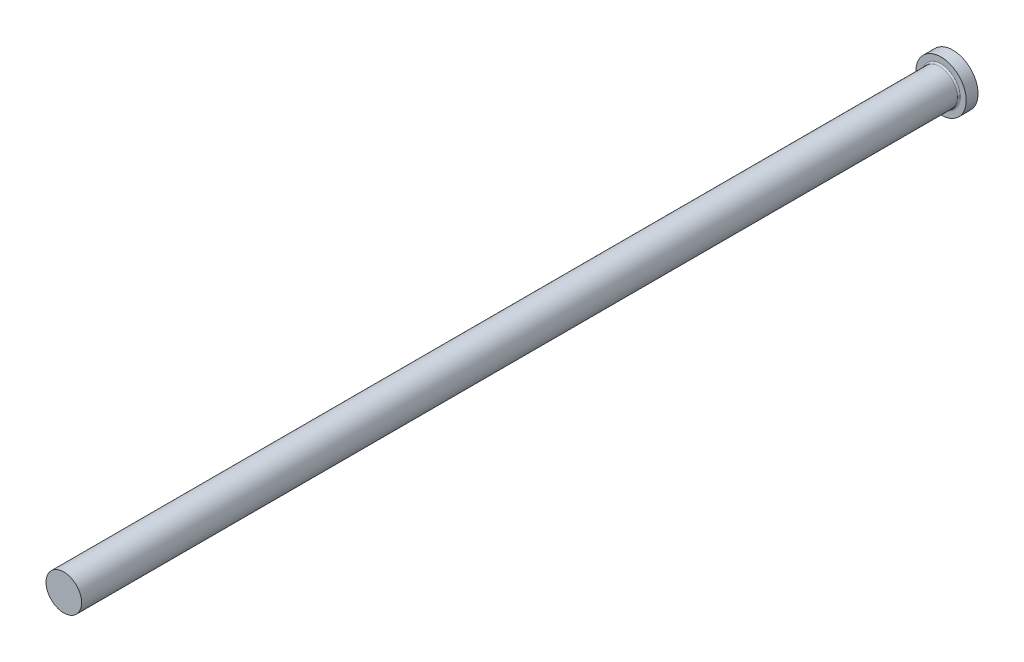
ISO-10303-21;
HEADER;
FILE_DESCRIPTION(('STEP AP214'),'2;1');
FILE_NAME('part.step','',(''),(''),'','','');
FILE_SCHEMA(('AUTOMOTIVE_DESIGN { 1 0 10303 214 1 1 1 1 }'));
ENDSEC;
DATA;
#1=APPLICATION_CONTEXT('core data for automotive mechanical design processes');
#2=APPLICATION_PROTOCOL_DEFINITION('international standard','automotive_design',2000,#1);
#3=PRODUCT_CONTEXT('',#1,'mechanical');
#4=PRODUCT('Part','Part','',(#3));
#5=PRODUCT_RELATED_PRODUCT_CATEGORY('part','',(#4));
#6=PRODUCT_DEFINITION_FORMATION('','',#4);
#7=PRODUCT_DEFINITION_CONTEXT('part definition',#1,'design');
#8=PRODUCT_DEFINITION('design','',#6,#7);
#9=PRODUCT_DEFINITION_SHAPE('','',#8);
#10=(LENGTH_UNIT() NAMED_UNIT(*) SI_UNIT(.MILLI.,.METRE.));
#11=(NAMED_UNIT(*) PLANE_ANGLE_UNIT() SI_UNIT($,.RADIAN.));
#12=(NAMED_UNIT(*) SI_UNIT($,.STERADIAN.) SOLID_ANGLE_UNIT());
#13=UNCERTAINTY_MEASURE_WITH_UNIT(LENGTH_MEASURE(1.E-05),#10,'distance_accuracy_value','');
#14=(GEOMETRIC_REPRESENTATION_CONTEXT(3) GLOBAL_UNCERTAINTY_ASSIGNED_CONTEXT((#13)) GLOBAL_UNIT_ASSIGNED_CONTEXT((#10,
#11,#12)) REPRESENTATION_CONTEXT('',''));
#15=CARTESIAN_POINT('',(0.,0.,0.));
#16=DIRECTION('',(0.,0.,1.));
#17=DIRECTION('',(1.,0.,0.));
#18=AXIS2_PLACEMENT_3D('',#15,#16,#17);
#19=CARTESIAN_POINT('',(8.5,0.,4.));
#20=DIRECTION('',(0.,0.,-1.));
#21=DIRECTION('',(-1.,0.,0.));
#22=AXIS2_PLACEMENT_3D('',#19,#20,#21);
#23=PLANE('',#22);
#24=CARTESIAN_POINT('',(0.,0.,4.));
#25=DIRECTION('',(0.,0.,-1.));
#26=DIRECTION('',(-1.,0.,0.));
#27=AXIS2_PLACEMENT_3D('',#24,#25,#26);
#28=CIRCLE('',#27,6.50000000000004);
#29=CARTESIAN_POINT('',(-6.50000000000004,0.,4.));
#30=VERTEX_POINT('',#29);
#31=EDGE_CURVE('E40',#30,#30,#28,.T.);
#32=ORIENTED_EDGE('',*,*,#31,.T.);
#33=EDGE_LOOP('',(#32));
#34=FACE_BOUND('',#33,.T.);
#35=CARTESIAN_POINT('',(0.,0.,4.));
#36=DIRECTION('',(0.,0.,-1.));
#37=DIRECTION('',(-1.,0.,0.));
#38=AXIS2_PLACEMENT_3D('',#35,#36,#37);
#39=CIRCLE('',#38,8.5);
#40=CARTESIAN_POINT('',(-8.5,0.,4.));
#41=VERTEX_POINT('',#40);
#42=EDGE_CURVE('E44',#41,#41,#39,.T.);
#43=ORIENTED_EDGE('',*,*,#42,.F.);
#44=EDGE_LOOP('',(#43));
#45=FACE_BOUND('',#44,.T.);
#46=ADVANCED_FACE('F33',(#34,#45),#23,.F.);
#47=CARTESIAN_POINT('',(0.,0.,-9.03322817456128));
#48=DIRECTION('',(0.,0.,-1.));
#49=DIRECTION('',(-1.,0.,0.));
#50=AXIS2_PLACEMENT_3D('',#47,#48,#49);
#51=CYLINDRICAL_SURFACE('',#50,8.5);
#52=CARTESIAN_POINT('',(0.,0.,0.));
#53=DIRECTION('',(0.,0.,-1.));
#54=DIRECTION('',(-1.,0.,0.));
#55=AXIS2_PLACEMENT_3D('',#52,#53,#54);
#56=CIRCLE('',#55,8.5);
#57=CARTESIAN_POINT('',(-8.5,0.,0.));
#58=VERTEX_POINT('',#57);
#59=EDGE_CURVE('E48',#58,#58,#56,.T.);
#60=ORIENTED_EDGE('',*,*,#59,.F.);
#61=EDGE_LOOP('',(#60));
#62=FACE_BOUND('',#61,.T.);
#63=ORIENTED_EDGE('',*,*,#42,.T.);
#64=EDGE_LOOP('',(#63));
#65=FACE_BOUND('',#64,.T.);
#66=ADVANCED_FACE('F68',(#62,#65),#51,.T.);
#67=CARTESIAN_POINT('',(0.,0.,0.));
#68=DIRECTION('',(0.,0.,1.));
#69=DIRECTION('',(1.,0.,0.));
#70=AXIS2_PLACEMENT_3D('',#67,#68,#69);
#71=PLANE('',#70);
#72=ORIENTED_EDGE('',*,*,#59,.T.);
#73=EDGE_LOOP('',(#72));
#74=FACE_BOUND('',#73,.T.);
#75=ADVANCED_FACE('F61',(#74),#71,.F.);
#76=CARTESIAN_POINT('',(0.,0.,300.));
#77=DIRECTION('',(0.,0.,-1.));
#78=DIRECTION('',(-1.,0.,0.));
#79=AXIS2_PLACEMENT_3D('',#76,#77,#78);
#80=PLANE('',#79);
#81=CARTESIAN_POINT('',(0.,0.,300.));
#82=DIRECTION('',(0.,0.,-1.));
#83=DIRECTION('',(-1.,0.,0.));
#84=AXIS2_PLACEMENT_3D('',#81,#82,#83);
#85=CIRCLE('',#84,6.00000000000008);
#86=CARTESIAN_POINT('',(-6.00000000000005,0.,300.));
#87=VERTEX_POINT('',#86);
#88=EDGE_CURVE('E53',#87,#87,#85,.T.);
#89=ORIENTED_EDGE('',*,*,#88,.F.);
#90=EDGE_LOOP('',(#89));
#91=FACE_BOUND('',#90,.T.);
#92=ADVANCED_FACE('F59',(#91),#80,.F.);
#93=CARTESIAN_POINT('',(0.,0.,-9.03322817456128));
#94=DIRECTION('',(0.,0.,-1.));
#95=DIRECTION('',(-1.,0.,0.));
#96=AXIS2_PLACEMENT_3D('',#93,#94,#95);
#97=CYLINDRICAL_SURFACE('',#96,6.00000000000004);
#98=CARTESIAN_POINT('',(0.,0.,4.5));
#99=DIRECTION('',(0.,0.,-1.));
#100=DIRECTION('',(-1.,0.,0.));
#101=AXIS2_PLACEMENT_3D('',#98,#99,#100);
#102=CIRCLE('',#101,6.00000000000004);
#103=CARTESIAN_POINT('',(-6.00000000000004,0.,4.5));
#104=VERTEX_POINT('',#103);
#105=EDGE_CURVE('E10',#104,#104,#102,.F.);
#106=ORIENTED_EDGE('',*,*,#105,.T.);
#107=EDGE_LOOP('',(#106));
#108=FACE_BOUND('',#107,.T.);
#109=ORIENTED_EDGE('',*,*,#88,.T.);
#110=EDGE_LOOP('',(#109));
#111=FACE_BOUND('',#110,.T.);
#112=ADVANCED_FACE('F57',(#108,#111),#97,.T.);
#113=CARTESIAN_POINT('',(0.,0.,4.5));
#114=DIRECTION('',(0.,0.,-1.));
#115=DIRECTION('',(-1.,0.,0.));
#116=AXIS2_PLACEMENT_3D('',#113,#114,#115);
#117=TOROIDAL_SURFACE('',#116,6.50000000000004,0.5);
#118=ORIENTED_EDGE('',*,*,#105,.F.);
#119=EDGE_LOOP('',(#118));
#120=FACE_BOUND('',#119,.T.);
#121=ORIENTED_EDGE('',*,*,#31,.F.);
#122=EDGE_LOOP('',(#121));
#123=FACE_BOUND('',#122,.T.);
#124=ADVANCED_FACE('F35',(#120,#123),#117,.F.);
#125=CLOSED_SHELL('',(#46,#66,#75,#92,#112,#124));
#126=MANIFOLD_SOLID_BREP('B2',#125);
#127=ADVANCED_BREP_SHAPE_REPRESENTATION('',(#18,#126),#14);
#128=SHAPE_DEFINITION_REPRESENTATION(#9,#127);
ENDSEC;
END-ISO-10303-21;
